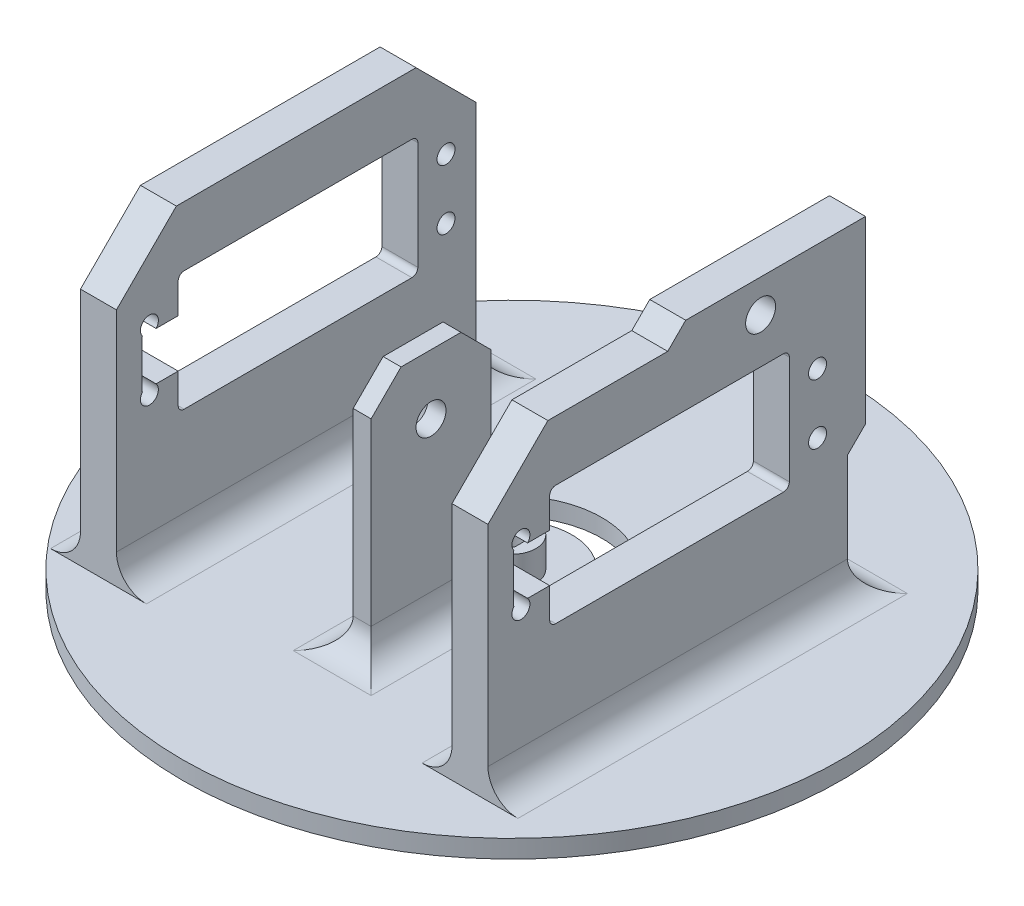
from build123d import *

# Parameters (mm, degrees)
CROQUIS1_R              = 55
SALIENTE_EXTRUIR1_DEPTH = 1.5
CORTAR_EXTRUIR1_DEPTH   = 78.839578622
CROQUIS3_W              = 3
CROQUIS3_H              = 20
SALIENTE_EXTRUIR2_DEPTH = 40
REDONDEO1_R             = 5
CHAFL_N1_SIZE           = 5
CROQUIS4_R              = 2.5
CORTAR_EXTRUIR2_DEPTH   = 90.10387197
CROQUIS5_W              = 6
CROQUIS5_H              = 60
SALIENTE_EXTRUIR3_DEPTH = 50
REDONDEO3_R             = 5
REDONDEO4_R             = 5
REDONDEO5_R             = 5
REDONDEO6_R             = 5
REDONDEO7_R             = 5
REDONDEO8_R             = 5
SALIENTE_EXTRUIR4_START = 5
CROQUIS6_R              = 4
SALIENTE_EXTRUIR4_DEPTH = 5
CHAFL_N2_SIZE           = 10
CORTAR_EXTRUIR3_REACH   = 116.715
CROQUIS8_R              = 1.5
CORTAR_EXTRUIR4_DEPTH   = 115.714863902
CORTAR_EXTRUIR5_REACH   = 120.531
SALIENTE_EXTRUIR5_DEPTH = 6
CORTAR_EXTRUIR6_REACH   = 118.093
CROQUIS12_R             = 2.5


with BuildPart() as part:
    # Croquis1 → Saliente-Extruir1 (new, symmetric)
    with BuildSketch(Plane(origin=(0, 0, 0), x_dir=(1, 0, 0), z_dir=(0, 1, 0))):
        with Locations(Location((0, 0, 0), (0, 0, 270))):
            Circle(CROQUIS1_R)
    extrude(amount=SALIENTE_EXTRUIR1_DEPTH, both=True)

    # Croquis2 → Cortar-Extruir1 (cut, through all)
    with BuildSketch(Plane(origin=(0, 1.5, 0), x_dir=(1, 0, 0), z_dir=(0, 1, 0))):
        with BuildLine():
            Line((-10.606601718, 10.606601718), (-7.071067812, 7.071067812))
            ThreePointArc((-7.071067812, 7.071067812), (0, 10), (7.071067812, 7.071067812))
            Line((7.071067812, 7.071067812), (10.606601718, 10.606601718))
            ThreePointArc((10.606601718, 10.606601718), (0, 15), (-10.606601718, 10.606601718))
        make_face()
        with BuildLine():
            Line((2, 1.5), (2, -1.5))
            ThreePointArc((2, -1.5), (-2.5, 0), (2, 1.5))
        make_face()
    extrude(amount=-CORTAR_EXTRUIR1_DEPTH, mode=Mode.SUBTRACT)

    # Croquis3 → Saliente-Extruir2 (add)
    with BuildSketch(Plane(origin=(0, 1.5, 0), x_dir=(1, 0, 0), z_dir=(0, 1, 0))):
        with Locations((0, -15)):
            Rectangle(CROQUIS3_W, CROQUIS3_H)
    extrude(amount=SALIENTE_EXTRUIR2_DEPTH)

    # Redondeo1
    redondeo1_edges = [part.edges().sort_by_distance(p)[0] for p in [
        (1.5, 1.5, 15),
        (-1.5, 1.5, 15),
        (0, 1.5, 25),
    ]]
    fillet(redondeo1_edges, radius=REDONDEO1_R)

    # Chafl_n1
    chafl_n1_edges = [part.edges().sort_by_distance(p)[0] for p in [
        (0, 41.5, 5),
        (0, 41.5, 25),
    ]]
    chamfer(chafl_n1_edges, length=CHAFL_N1_SIZE)

    # Croquis4 → Cortar-Extruir2 (cut, through all)
    with BuildSketch(Plane(origin=(1.5, 0, 0), x_dir=(0, 0, -1), z_dir=(1, 0, 0))):
        with Locations((-15, 31.5)):
            Circle(CROQUIS4_R)
    extrude(amount=-CORTAR_EXTRUIR2_DEPTH, mode=Mode.SUBTRACT)

    # Croquis5 → Saliente-Extruir3 (add)
    with BuildSketch(Plane(origin=(0, 1.5, 0), x_dir=(1, 0, 0), z_dir=(0, 1, 0))):
        with Locations((28.5, -5.5)):
            Rectangle(CROQUIS5_W, CROQUIS5_H)
        with Locations((-33.5, -5.5)):
            Rectangle(CROQUIS5_W, CROQUIS5_H)
    extrude(amount=SALIENTE_EXTRUIR3_DEPTH)

    # Redondeo3
    redondeo3_edges = [part.edges().sort_by_distance(p)[0] for p in [
        (-36.5, 1.5, 5.5),
    ]]
    fillet(redondeo3_edges, radius=REDONDEO3_R)

    # Redondeo4
    redondeo4_edges = [part.edges().sort_by_distance(p)[0] for p in [
        (25.5, 1.5, 5.5),
    ]]
    fillet(redondeo4_edges, radius=REDONDEO4_R)

    # Redondeo5
    redondeo5_edges = [part.edges().sort_by_distance(p)[0] for p in [
        (-30.5, 1.5, 5.5),
    ]]
    fillet(redondeo5_edges, radius=REDONDEO5_R)

    # Redondeo6
    redondeo6_edges = [part.edges().sort_by_distance(p)[0] for p in [
        (31.5, 1.5, 5.5),
    ]]
    fillet(redondeo6_edges, radius=REDONDEO6_R)

    # Redondeo7
    redondeo7_edges = [part.edges().sort_by_distance(p)[0] for p in [
        (28.5, 1.5, -24.5),
    ]]
    fillet(redondeo7_edges, radius=REDONDEO7_R)

    # Redondeo8
    redondeo8_edges = [part.edges().sort_by_distance(p)[0] for p in [
        (-33.5, 1.5, -24.5),
    ]]
    fillet(redondeo8_edges, radius=REDONDEO8_R)

    # Croquis6 → Saliente-Extruir4 (add)
    with BuildSketch(Plane(origin=(0, 1.5, 0), x_dir=(1, 0, 0), z_dir=(0, 1, 0)).offset(SALIENTE_EXTRUIR4_START)):
        with Locations(Location((0, 0, 0), (0, 0, 270))):
            Circle(CROQUIS6_R)
        with BuildLine():
            Line((2, -1.5), (2, 1.5))
            ThreePointArc((2, 1.5), (-2.5, 0), (2, -1.5))
        make_face(mode=Mode.SUBTRACT)
    extrude(amount=-SALIENTE_EXTRUIR4_DEPTH)

    # Chafl_n2
    chafl_n2_edges = [part.edges().sort_by_distance(p)[0] for p in [
        (28.5, 51.5, -24.5),
        (28.5, 51.5, 35.5),
        (-33.5, 51.5, -24.5),
        (-33.5, 51.5, 35.5),
    ]]
    chamfer(chafl_n2_edges, length=CHAFL_N2_SIZE)

    # Croquis7 → Cortar-Extruir3 (cut, up to next)
    with BuildSketch(Plane(origin=(31.5, 0, 0), x_dir=(0, 0, -1), z_dir=(1, 0, 0)), mode=Mode.PRIVATE) as cortar_extruir3_sk1:
        with BuildLine():
            Line((-24.2, 41.5), (13.8, 41.5))
            ThreePointArc((13.8, 41.5), (14.507106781, 41.207106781), (14.8, 40.5))
            Line((14.8, 40.5), (14.8, 22.5))
            ThreePointArc((14.8, 22.5), (14.507106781, 21.792893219), (13.8, 21.5))
            Line((13.8, 21.5), (-24.2, 21.5))
            ThreePointArc((-24.2, 21.5), (-24.907106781, 21.792893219), (-25.2, 22.5))
            Line((-25.2, 22.5), (-25.2, 27.5))
            Line((-25.2, 27.5), (-31.2, 27.5))
            Line((-31.2, 27.5), (-31.2, 35.5))
            Line((-31.2, 35.5), (-25.2, 35.5))
            Line((-25.2, 35.5), (-25.2, 40.5))
            ThreePointArc((-25.2, 40.5), (-24.907106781, 41.207106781), (-24.2, 41.5))
        make_face()
    cortar_extruir3_tool1 = extrude(cortar_extruir3_sk1.sketch, amount=-CORTAR_EXTRUIR3_REACH, mode=Mode.PRIVATE) & part.part
    add(cortar_extruir3_tool1.solids().sort_by_distance((31.5, 31.5, 6.503206))[0], mode=Mode.SUBTRACT)

    # Croquis8 → Cortar-Extruir4 (cut, through all)
    with BuildSketch(Plane(origin=(31.5, 0, 0), x_dir=(0, 0, -1), z_dir=(1, 0, 0))):
        with Locations((-30, 36.499999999)):
            Circle(CROQUIS8_R)
        with Locations((19.5, 36.499999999)):
            Circle(CROQUIS8_R)
        with Locations((-30, 26.499999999)):
            Circle(CROQUIS8_R)
        with Locations((19.5, 26.499999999)):
            Circle(CROQUIS8_R)
    extrude(amount=-CORTAR_EXTRUIR4_DEPTH, mode=Mode.SUBTRACT)

    # Croquis10 → Cortar-Extruir5 (cut, up to next)
    with BuildSketch(Plane.ZY.offset(36.5), mode=Mode.PRIVATE) as cortar_extruir5_sk1:
        with BuildLine():
            Line((28.88196601, 35.5), (25.2, 35.5))
            Line((25.2, 35.5), (25.2, 40.5))
            ThreePointArc((25.2, 40.5), (24.907106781, 41.207106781), (24.2, 41.5))
            Line((24.2, 41.5), (-13.8, 41.5))
            ThreePointArc((-13.8, 41.5), (-14.507106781, 41.207106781), (-14.8, 40.5))
            Line((-14.8, 40.5), (-14.8, 22.5))
            ThreePointArc((-14.8, 22.5), (-14.507106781, 21.792893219), (-13.8, 21.5))
            Line((-13.8, 21.5), (24.2, 21.5))
            ThreePointArc((24.2, 21.5), (24.907106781, 21.792893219), (25.2, 22.5))
            Line((25.2, 22.5), (25.2, 27.5))
            Line((25.2, 27.5), (28.881966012, 27.5))
            Line((28.881966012, 27.5), (31.2, 27.5))
            Line((31.2, 27.5), (31.2, 35.5))
            Line((31.2, 35.5), (28.88196601, 35.5))
        make_face()
    cortar_extruir5_tool1 = extrude(cortar_extruir5_sk1.sketch, amount=-CORTAR_EXTRUIR5_REACH, mode=Mode.PRIVATE) & part.part
    add(cortar_extruir5_tool1.solids().sort_by_distance((-36.5, 31.5, 6.503206))[0], mode=Mode.SUBTRACT)

    # Croquis11 → Saliente-Extruir5 (add)
    with BuildSketch(Plane(origin=(31.5, 0, 0), x_dir=(0, 0, -1), z_dir=(1, 0, 0))):
        Polygon((-5.5, 51.5), (-2.5, 54.5), (27.5, 54.5), (27.5, 24.5), (24.5, 21.5), (24.5, 41.5), (14.5, 51.5), align=None)
    extrude(amount=-SALIENTE_EXTRUIR5_DEPTH)

    # Croquis12 → Cortar-Extruir6 (cut, up to next)
    with BuildSketch(Plane(origin=(31.5, 0, 0), x_dir=(0, 0, -1), z_dir=(1, 0, 0)), mode=Mode.PRIVATE) as cortar_extruir6_sk1:
        with Locations((10, 49.01)):
            Circle(CROQUIS12_R)
    cortar_extruir6_tool1 = extrude(cortar_extruir6_sk1.sketch, amount=-CORTAR_EXTRUIR6_REACH, mode=Mode.PRIVATE) & part.part
    add(cortar_extruir6_tool1.solids().sort_by_distance((31.5, 49.01, -10))[0], mode=Mode.SUBTRACT)


solid = part.part
